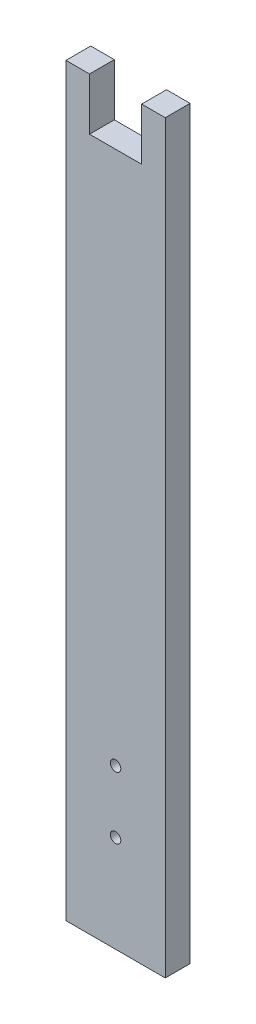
from build123d import *

# Parameters (mm, degrees)
SKETCH1_W           = 40
SKETCH1_H           = 300
BOSS_EXTRUDE1_DEPTH = 10
SKETCH3_R           = 2.1
CUT_EXTRUDE2_DEPTH  = 301.83217913
SKETCH4_W           = 21
SKETCH4_H           = 21
CUT_EXTRUDE3_DEPTH  = 301.83217913


with BuildPart() as part:
    # Sketch1 → Boss-Extrude1 (new body)
    with BuildSketch(Plane.XY):
        with Locations((0, 150)):
            Rectangle(SKETCH1_W, SKETCH1_H)
    extrude(amount=BOSS_EXTRUDE1_DEPTH)

    # Sketch3 → Cut-Extrude2 (cut, through all)
    with BuildSketch(Plane(origin=(0, 0, 0), x_dir=(-1, 0, 0), z_dir=(0, 0, -1))):
        with Locations((0, 64)):
            Circle(SKETCH3_R)
        with Locations((0, 39)):
            Circle(SKETCH3_R)
    extrude(amount=-CUT_EXTRUDE2_DEPTH, mode=Mode.SUBTRACT)

    # Sketch4 → Cut-Extrude3 (cut, through all)
    with BuildSketch(Plane.XY):
        with Locations((0, 289.5)):
            Rectangle(SKETCH4_W, SKETCH4_H)
    extrude(amount=CUT_EXTRUDE3_DEPTH, mode=Mode.SUBTRACT)


solid = part.part
